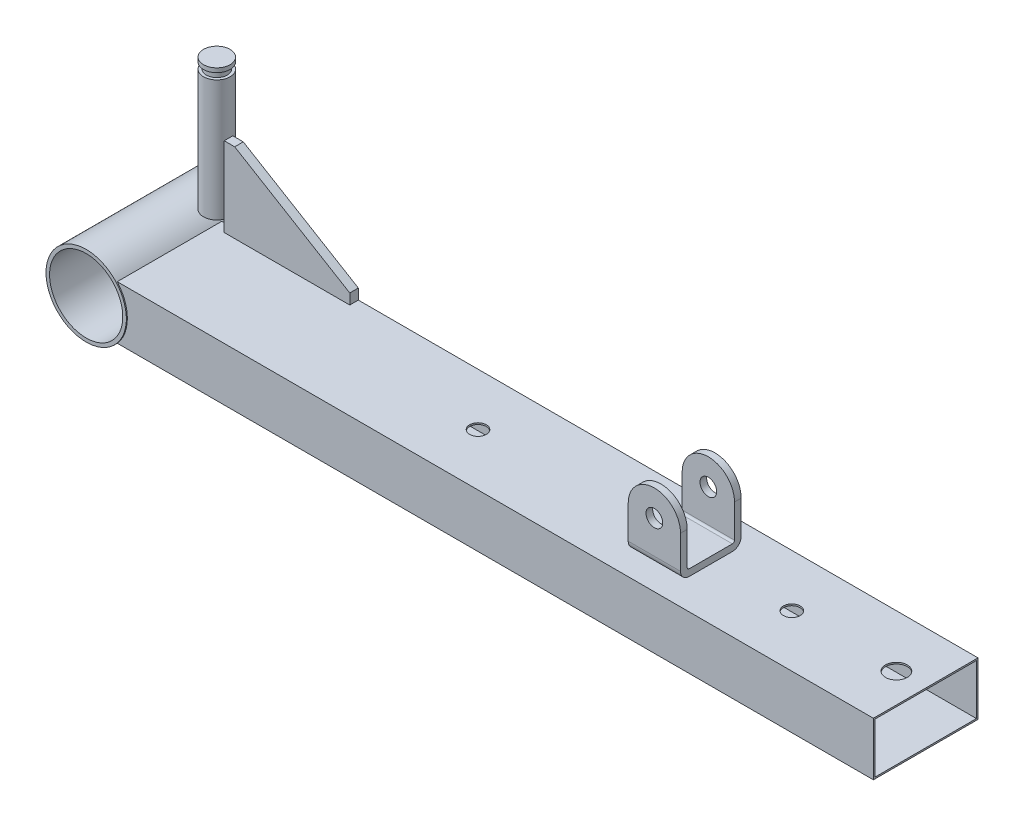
ISO-10303-21;
HEADER;
FILE_DESCRIPTION(('STEP AP214'),'2;1');
FILE_NAME('part.step','',(''),(''),'','','');
FILE_SCHEMA(('AUTOMOTIVE_DESIGN { 1 0 10303 214 1 1 1 1 }'));
ENDSEC;
DATA;
#1=APPLICATION_CONTEXT('core data for automotive mechanical design processes');
#2=APPLICATION_PROTOCOL_DEFINITION('international standard','automotive_design',2000,#1);
#3=PRODUCT_CONTEXT('',#1,'mechanical');
#4=PRODUCT('Part','Part','',(#3));
#5=PRODUCT_RELATED_PRODUCT_CATEGORY('part','',(#4));
#6=PRODUCT_DEFINITION_FORMATION('','',#4);
#7=PRODUCT_DEFINITION_CONTEXT('part definition',#1,'design');
#8=PRODUCT_DEFINITION('design','',#6,#7);
#9=PRODUCT_DEFINITION_SHAPE('','',#8);
#10=(LENGTH_UNIT() NAMED_UNIT(*) SI_UNIT(.MILLI.,.METRE.));
#11=(NAMED_UNIT(*) PLANE_ANGLE_UNIT() SI_UNIT($,.RADIAN.));
#12=(NAMED_UNIT(*) SI_UNIT($,.STERADIAN.) SOLID_ANGLE_UNIT());
#13=UNCERTAINTY_MEASURE_WITH_UNIT(LENGTH_MEASURE(1.E-05),#10,'distance_accuracy_value','');
#14=(GEOMETRIC_REPRESENTATION_CONTEXT(3) GLOBAL_UNCERTAINTY_ASSIGNED_CONTEXT((#13)) GLOBAL_UNIT_ASSIGNED_CONTEXT((#10,
#11,#12)) REPRESENTATION_CONTEXT('',''));
#15=CARTESIAN_POINT('',(0.,0.,0.));
#16=DIRECTION('',(0.,0.,1.));
#17=DIRECTION('',(1.,0.,0.));
#18=AXIS2_PLACEMENT_3D('',#15,#16,#17);
#19=CARTESIAN_POINT('',(6.674138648,80.75,18.535303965));
#20=DIRECTION('',(0.,1.,0.));
#21=DIRECTION('',(0.,0.,1.));
#22=AXIS2_PLACEMENT_3D('',#19,#20,#21);
#23=PLANE('',#22);
#24=CARTESIAN_POINT('',(13.15,80.75,25.));
#25=DIRECTION('',(0.,-1.,0.));
#26=DIRECTION('',(1.,0.,0.));
#27=AXIS2_PLACEMENT_3D('',#24,#25,#26);
#28=CIRCLE('',#27,6.35);
#29=CARTESIAN_POINT('',(19.5,80.75,25.));
#30=VERTEX_POINT('',#29);
#31=EDGE_CURVE('E38',#30,#30,#28,.T.);
#32=ORIENTED_EDGE('',*,*,#31,.F.);
#33=EDGE_LOOP('',(#32));
#34=FACE_BOUND('',#33,.T.);
#35=ADVANCED_FACE('F34',(#34),#23,.T.);
#36=CARTESIAN_POINT('',(13.15,80.75,25.));
#37=DIRECTION('',(0.,-1.,0.));
#38=DIRECTION('',(1.,0.,0.));
#39=AXIS2_PLACEMENT_3D('',#36,#37,#38);
#40=CYLINDRICAL_SURFACE('',#39,6.35);
#41=ORIENTED_EDGE('',*,*,#31,.T.);
#42=EDGE_LOOP('',(#41));
#43=FACE_BOUND('',#42,.T.);
#44=CARTESIAN_POINT('',(13.15,78.75,25.));
#45=DIRECTION('',(0.,-1.,0.));
#46=DIRECTION('',(1.,0.,0.));
#47=AXIS2_PLACEMENT_3D('',#44,#45,#46);
#48=CIRCLE('',#47,6.35);
#49=CARTESIAN_POINT('',(19.5,78.75,25.));
#50=VERTEX_POINT('',#49);
#51=EDGE_CURVE('E606',#50,#50,#48,.F.);
#52=ORIENTED_EDGE('',*,*,#51,.T.);
#53=EDGE_LOOP('',(#52));
#54=FACE_BOUND('',#53,.T.);
#55=ADVANCED_FACE('F307',(#43,#54),#40,.T.);
#56=CARTESIAN_POINT('',(6.674138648,78.75,18.535303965));
#57=DIRECTION('',(0.,1.,0.));
#58=DIRECTION('',(0.,0.,1.));
#59=AXIS2_PLACEMENT_3D('',#56,#57,#58);
#60=PLANE('',#59);
#61=CARTESIAN_POINT('',(13.15,78.75,25.));
#62=DIRECTION('',(0.,-1.,0.));
#63=DIRECTION('',(0.,0.,-1.));
#64=AXIS2_PLACEMENT_3D('',#61,#62,#63);
#65=CIRCLE('',#64,5.);
#66=CARTESIAN_POINT('',(13.15,78.75,20.));
#67=VERTEX_POINT('',#66);
#68=EDGE_CURVE('E604',#67,#67,#65,.T.);
#69=ORIENTED_EDGE('',*,*,#68,.F.);
#70=EDGE_LOOP('',(#69));
#71=FACE_BOUND('',#70,.T.);
#72=ORIENTED_EDGE('',*,*,#51,.F.);
#73=EDGE_LOOP('',(#72));
#74=FACE_BOUND('',#73,.T.);
#75=ADVANCED_FACE('F309',(#71,#74),#60,.F.);
#76=CARTESIAN_POINT('',(13.15,78.75,25.));
#77=DIRECTION('',(0.,-1.,0.));
#78=DIRECTION('',(0.,0.,-1.));
#79=AXIS2_PLACEMENT_3D('',#76,#77,#78);
#80=CYLINDRICAL_SURFACE('',#79,5.);
#81=CARTESIAN_POINT('',(13.15,75.75,25.));
#82=DIRECTION('',(0.,-1.,0.));
#83=DIRECTION('',(0.,0.,-1.));
#84=AXIS2_PLACEMENT_3D('',#81,#82,#83);
#85=CIRCLE('',#84,5.);
#86=CARTESIAN_POINT('',(13.15,75.75,20.));
#87=VERTEX_POINT('',#86);
#88=EDGE_CURVE('E601',#87,#87,#85,.T.);
#89=ORIENTED_EDGE('',*,*,#88,.F.);
#90=EDGE_LOOP('',(#89));
#91=FACE_BOUND('',#90,.T.);
#92=ORIENTED_EDGE('',*,*,#68,.T.);
#93=EDGE_LOOP('',(#92));
#94=FACE_BOUND('',#93,.T.);
#95=ADVANCED_FACE('F312',(#91,#94),#80,.T.);
#96=CARTESIAN_POINT('',(260.6,32.75,60.1));
#97=DIRECTION('',(0.,0.,1.));
#98=DIRECTION('',(1.,0.,0.));
#99=AXIS2_PLACEMENT_3D('',#96,#97,#98);
#100=CYLINDRICAL_SURFACE('',#99,3.99999999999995);
#101=CARTESIAN_POINT('',(260.6,32.75,63.3));
#102=DIRECTION('',(0.,0.,1.));
#103=DIRECTION('',(1.,0.,0.));
#104=AXIS2_PLACEMENT_3D('',#101,#102,#103);
#105=CIRCLE('',#104,3.99999999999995);
#106=CARTESIAN_POINT('',(264.6,32.75,63.3));
#107=VERTEX_POINT('',#106);
#108=EDGE_CURVE('E595',#107,#107,#105,.F.);
#109=ORIENTED_EDGE('',*,*,#108,.F.);
#110=EDGE_LOOP('',(#109));
#111=FACE_BOUND('',#110,.T.);
#112=CARTESIAN_POINT('',(260.6,32.75,60.1));
#113=DIRECTION('',(0.,0.,1.));
#114=DIRECTION('',(1.,0.,0.));
#115=AXIS2_PLACEMENT_3D('',#112,#113,#114);
#116=CIRCLE('',#115,3.99999999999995);
#117=CARTESIAN_POINT('',(264.6,32.75,60.1));
#118=VERTEX_POINT('',#117);
#119=EDGE_CURVE('E192',#118,#118,#116,.T.);
#120=ORIENTED_EDGE('',*,*,#119,.F.);
#121=EDGE_LOOP('',(#120));
#122=FACE_BOUND('',#121,.T.);
#123=ADVANCED_FACE('F620',(#111,#122),#100,.F.);
#124=CARTESIAN_POINT('',(260.6,32.75,34.3));
#125=DIRECTION('',(0.,0.,1.));
#126=DIRECTION('',(1.,0.,0.));
#127=AXIS2_PLACEMENT_3D('',#124,#125,#126);
#128=CYLINDRICAL_SURFACE('',#127,3.99999999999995);
#129=CARTESIAN_POINT('',(260.6,32.75,37.5));
#130=DIRECTION('',(0.,0.,1.));
#131=DIRECTION('',(1.,0.,0.));
#132=AXIS2_PLACEMENT_3D('',#129,#130,#131);
#133=CIRCLE('',#132,3.99999999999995);
#134=CARTESIAN_POINT('',(264.6,32.75,37.5));
#135=VERTEX_POINT('',#134);
#136=EDGE_CURVE('E553',#135,#135,#133,.F.);
#137=ORIENTED_EDGE('',*,*,#136,.F.);
#138=EDGE_LOOP('',(#137));
#139=FACE_BOUND('',#138,.T.);
#140=CARTESIAN_POINT('',(260.6,32.75,34.3));
#141=DIRECTION('',(0.,0.,1.));
#142=DIRECTION('',(1.,0.,0.));
#143=AXIS2_PLACEMENT_3D('',#140,#141,#142);
#144=CIRCLE('',#143,3.99999999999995);
#145=CARTESIAN_POINT('',(264.6,32.75,34.3));
#146=VERTEX_POINT('',#145);
#147=EDGE_CURVE('E592',#146,#146,#144,.T.);
#148=ORIENTED_EDGE('',*,*,#147,.F.);
#149=EDGE_LOOP('',(#148));
#150=FACE_BOUND('',#149,.T.);
#151=ADVANCED_FACE('F317',(#139,#150),#128,.F.);
#152=CARTESIAN_POINT('',(6.674138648,75.75,18.535303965));
#153=DIRECTION('',(0.,1.,0.));
#154=DIRECTION('',(0.,0.,1.));
#155=AXIS2_PLACEMENT_3D('',#152,#153,#154);
#156=PLANE('',#155);
#157=ORIENTED_EDGE('',*,*,#88,.T.);
#158=EDGE_LOOP('',(#157));
#159=FACE_BOUND('',#158,.T.);
#160=CARTESIAN_POINT('',(13.15,75.75,25.));
#161=DIRECTION('',(0.,-1.,0.));
#162=DIRECTION('',(0.,0.,-1.));
#163=AXIS2_PLACEMENT_3D('',#160,#161,#162);
#164=CIRCLE('',#163,6.35);
#165=CARTESIAN_POINT('',(13.15,75.75,18.65));
#166=VERTEX_POINT('',#165);
#167=EDGE_CURVE('E545',#166,#166,#164,.T.);
#168=ORIENTED_EDGE('',*,*,#167,.F.);
#169=EDGE_LOOP('',(#168));
#170=FACE_BOUND('',#169,.T.);
#171=ADVANCED_FACE('F314',(#159,#170),#156,.T.);
#172=CARTESIAN_POINT('',(273.1,16.95,60.1));
#173=DIRECTION('',(0.,0.,-1.));
#174=DIRECTION('',(-1.,0.,0.));
#175=AXIS2_PLACEMENT_3D('',#172,#173,#174);
#176=PLANE('',#175);
#177=ORIENTED_EDGE('',*,*,#119,.T.);
#178=EDGE_LOOP('',(#177));
#179=FACE_BOUND('',#178,.T.);
#180=DIRECTION('',(-1.,0.,0.));
#181=VECTOR('',#180,1.);
#182=CARTESIAN_POINT('',(260.6,16.9499999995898,60.1));
#183=LINE('',#182,#181);
#184=CARTESIAN_POINT('',(273.1,16.9499999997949,60.099999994));
#185=VERTEX_POINT('',#184);
#186=CARTESIAN_POINT('',(248.1,16.9499999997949,60.099999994));
#187=VERTEX_POINT('',#186);
#188=EDGE_CURVE('E546',#185,#187,#183,.T.);
#189=ORIENTED_EDGE('',*,*,#188,.T.);
#190=DIRECTION('',(0.,1.,0.));
#191=VECTOR('',#190,1.);
#192=CARTESIAN_POINT('',(248.1,22.75,60.099999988));
#193=LINE('',#192,#191);
#194=CARTESIAN_POINT('',(248.1,32.75,60.099999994));
#195=VERTEX_POINT('',#194);
#196=EDGE_CURVE('E187',#187,#195,#193,.T.);
#197=ORIENTED_EDGE('',*,*,#196,.T.);
#198=CARTESIAN_POINT('',(260.6,32.75,60.1));
#199=DIRECTION('',(0.,0.,1.));
#200=DIRECTION('',(1.,0.,0.));
#201=AXIS2_PLACEMENT_3D('',#198,#199,#200);
#202=CIRCLE('',#201,12.5);
#203=CARTESIAN_POINT('',(273.1,32.75,60.099999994));
#204=VERTEX_POINT('',#203);
#205=EDGE_CURVE('E184',#204,#195,#202,.T.);
#206=ORIENTED_EDGE('',*,*,#205,.F.);
#207=DIRECTION('',(0.,1.,0.));
#208=VECTOR('',#207,1.);
#209=CARTESIAN_POINT('',(273.1,22.75,60.099999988));
#210=LINE('',#209,#208);
#211=EDGE_CURVE('E171',#185,#204,#210,.T.);
#212=ORIENTED_EDGE('',*,*,#211,.F.);
#213=EDGE_LOOP('',(#189,#197,#206,#212));
#214=FACE_BOUND('',#213,.T.);
#215=ADVANCED_FACE('F185',(#179,#214),#176,.T.);
#216=CARTESIAN_POINT('',(260.6,32.75,60.1));
#217=DIRECTION('',(0.,0.,1.));
#218=DIRECTION('',(1.,0.,0.));
#219=AXIS2_PLACEMENT_3D('',#216,#217,#218);
#220=CYLINDRICAL_SURFACE('',#219,12.5);
#221=CARTESIAN_POINT('',(260.6,32.75,63.3));
#222=DIRECTION('',(0.,0.,-1.));
#223=DIRECTION('',(-1.,0.,0.));
#224=AXIS2_PLACEMENT_3D('',#221,#222,#223);
#225=CIRCLE('',#224,12.5000000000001);
#226=CARTESIAN_POINT('',(273.1,32.75,63.3));
#227=VERTEX_POINT('',#226);
#228=CARTESIAN_POINT('',(248.1,32.75,63.3));
#229=VERTEX_POINT('',#228);
#230=EDGE_CURVE('E191',#227,#229,#225,.F.);
#231=ORIENTED_EDGE('',*,*,#230,.F.);
#232=DIRECTION('',(0.,0.,1.));
#233=VECTOR('',#232,1.);
#234=CARTESIAN_POINT('',(273.1,32.75,48.8));
#235=LINE('',#234,#233);
#236=EDGE_CURVE('E175',#204,#227,#235,.T.);
#237=ORIENTED_EDGE('',*,*,#236,.F.);
#238=ORIENTED_EDGE('',*,*,#205,.T.);
#239=DIRECTION('',(0.,0.,1.));
#240=VECTOR('',#239,1.);
#241=CARTESIAN_POINT('',(248.1,32.75,48.8));
#242=LINE('',#241,#240);
#243=EDGE_CURVE('E203',#195,#229,#242,.T.);
#244=ORIENTED_EDGE('',*,*,#243,.T.);
#245=EDGE_LOOP('',(#231,#237,#238,#244));
#246=FACE_BOUND('',#245,.T.);
#247=ADVANCED_FACE('F194',(#246),#220,.T.);
#248=CARTESIAN_POINT('',(248.1,16.95,63.3));
#249=DIRECTION('',(0.,0.,1.));
#250=DIRECTION('',(1.,0.,0.));
#251=AXIS2_PLACEMENT_3D('',#248,#249,#250);
#252=PLANE('',#251);
#253=ORIENTED_EDGE('',*,*,#108,.T.);
#254=EDGE_LOOP('',(#253));
#255=FACE_BOUND('',#254,.T.);
#256=DIRECTION('',(0.,-1.,0.));
#257=VECTOR('',#256,1.);
#258=CARTESIAN_POINT('',(248.1,22.75,63.3));
#259=LINE('',#258,#257);
#260=CARTESIAN_POINT('',(248.1,16.9499999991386,63.3));
#261=VERTEX_POINT('',#260);
#262=EDGE_CURVE('E205',#229,#261,#259,.T.);
#263=ORIENTED_EDGE('',*,*,#262,.T.);
#264=DIRECTION('',(-1.,0.,0.));
#265=VECTOR('',#264,1.);
#266=CARTESIAN_POINT('',(260.6,16.9499999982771,63.3));
#267=LINE('',#266,#265);
#268=CARTESIAN_POINT('',(273.1,16.9499999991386,63.3));
#269=VERTEX_POINT('',#268);
#270=EDGE_CURVE('E201',#269,#261,#267,.T.);
#271=ORIENTED_EDGE('',*,*,#270,.F.);
#272=DIRECTION('',(0.,-1.,0.));
#273=VECTOR('',#272,1.);
#274=CARTESIAN_POINT('',(273.1,22.75,63.3));
#275=LINE('',#274,#273);
#276=EDGE_CURVE('E195',#227,#269,#275,.T.);
#277=ORIENTED_EDGE('',*,*,#276,.F.);
#278=ORIENTED_EDGE('',*,*,#230,.T.);
#279=EDGE_LOOP('',(#263,#271,#277,#278));
#280=FACE_BOUND('',#279,.T.);
#281=ADVANCED_FACE('F322',(#255,#280),#252,.T.);
#282=CARTESIAN_POINT('',(273.1,16.95,34.3));
#283=DIRECTION('',(0.,0.,-1.));
#284=DIRECTION('',(-1.,0.,0.));
#285=AXIS2_PLACEMENT_3D('',#282,#283,#284);
#286=PLANE('',#285);
#287=ORIENTED_EDGE('',*,*,#147,.T.);
#288=EDGE_LOOP('',(#287));
#289=FACE_BOUND('',#288,.T.);
#290=DIRECTION('',(1.,0.,0.));
#291=VECTOR('',#290,1.);
#292=CARTESIAN_POINT('',(260.6,16.9499999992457,34.3));
#293=LINE('',#292,#291);
#294=CARTESIAN_POINT('',(248.1,16.9499999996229,34.3));
#295=VERTEX_POINT('',#294);
#296=CARTESIAN_POINT('',(273.1,16.9499999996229,34.3));
#297=VERTEX_POINT('',#296);
#298=EDGE_CURVE('E180',#295,#297,#293,.T.);
#299=ORIENTED_EDGE('',*,*,#298,.F.);
#300=DIRECTION('',(0.,1.,0.));
#301=VECTOR('',#300,1.);
#302=CARTESIAN_POINT('',(248.1,22.75,34.3));
#303=LINE('',#302,#301);
#304=CARTESIAN_POINT('',(248.1,32.75,34.3));
#305=VERTEX_POINT('',#304);
#306=EDGE_CURVE('E209',#295,#305,#303,.T.);
#307=ORIENTED_EDGE('',*,*,#306,.T.);
#308=CARTESIAN_POINT('',(260.6,32.75,34.3));
#309=DIRECTION('',(0.,0.,1.));
#310=DIRECTION('',(1.,0.,0.));
#311=AXIS2_PLACEMENT_3D('',#308,#309,#310);
#312=CIRCLE('',#311,12.5);
#313=CARTESIAN_POINT('',(273.1,32.75,34.3));
#314=VERTEX_POINT('',#313);
#315=EDGE_CURVE('E590',#314,#305,#312,.T.);
#316=ORIENTED_EDGE('',*,*,#315,.F.);
#317=DIRECTION('',(0.,1.,0.));
#318=VECTOR('',#317,1.);
#319=CARTESIAN_POINT('',(273.1,22.75,34.3));
#320=LINE('',#319,#318);
#321=EDGE_CURVE('E557',#297,#314,#320,.T.);
#322=ORIENTED_EDGE('',*,*,#321,.F.);
#323=EDGE_LOOP('',(#299,#307,#316,#322));
#324=FACE_BOUND('',#323,.T.);
#325=ADVANCED_FACE('F325',(#289,#324),#286,.T.);
#326=CARTESIAN_POINT('',(260.6,32.75,34.3));
#327=DIRECTION('',(0.,0.,1.));
#328=DIRECTION('',(1.,0.,0.));
#329=AXIS2_PLACEMENT_3D('',#326,#327,#328);
#330=CYLINDRICAL_SURFACE('',#329,12.5);
#331=CARTESIAN_POINT('',(260.6,32.75,37.5));
#332=DIRECTION('',(0.,0.,-1.));
#333=DIRECTION('',(-1.,0.,0.));
#334=AXIS2_PLACEMENT_3D('',#331,#332,#333);
#335=CIRCLE('',#334,12.5000000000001);
#336=CARTESIAN_POINT('',(273.1,32.75,37.500000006));
#337=VERTEX_POINT('',#336);
#338=CARTESIAN_POINT('',(248.1,32.75,37.500000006));
#339=VERTEX_POINT('',#338);
#340=EDGE_CURVE('E588',#337,#339,#335,.F.);
#341=ORIENTED_EDGE('',*,*,#340,.F.);
#342=DIRECTION('',(0.,0.,1.));
#343=VECTOR('',#342,1.);
#344=CARTESIAN_POINT('',(273.1,32.75,48.8));
#345=LINE('',#344,#343);
#346=EDGE_CURVE('E554',#314,#337,#345,.T.);
#347=ORIENTED_EDGE('',*,*,#346,.F.);
#348=ORIENTED_EDGE('',*,*,#315,.T.);
#349=DIRECTION('',(0.,0.,1.));
#350=VECTOR('',#349,1.);
#351=CARTESIAN_POINT('',(248.1,32.75,48.8));
#352=LINE('',#351,#350);
#353=EDGE_CURVE('E206',#305,#339,#352,.T.);
#354=ORIENTED_EDGE('',*,*,#353,.T.);
#355=EDGE_LOOP('',(#341,#347,#348,#354));
#356=FACE_BOUND('',#355,.T.);
#357=ADVANCED_FACE('F329',(#356),#330,.T.);
#358=CARTESIAN_POINT('',(248.1,16.95,37.5));
#359=DIRECTION('',(0.,0.,1.));
#360=DIRECTION('',(1.,0.,0.));
#361=AXIS2_PLACEMENT_3D('',#358,#359,#360);
#362=PLANE('',#361);
#363=ORIENTED_EDGE('',*,*,#136,.T.);
#364=EDGE_LOOP('',(#363));
#365=FACE_BOUND('',#364,.T.);
#366=DIRECTION('',(0.,-1.,0.));
#367=VECTOR('',#366,1.);
#368=CARTESIAN_POINT('',(248.1,22.75,37.500000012));
#369=LINE('',#368,#367);
#370=CARTESIAN_POINT('',(248.1,16.9499999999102,37.500000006));
#371=VERTEX_POINT('',#370);
#372=EDGE_CURVE('E208',#339,#371,#369,.T.);
#373=ORIENTED_EDGE('',*,*,#372,.T.);
#374=DIRECTION('',(1.,0.,0.));
#375=VECTOR('',#374,1.);
#376=CARTESIAN_POINT('',(260.6,16.9499999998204,37.5));
#377=LINE('',#376,#375);
#378=CARTESIAN_POINT('',(273.1,16.9499999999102,37.500000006));
#379=VERTEX_POINT('',#378);
#380=EDGE_CURVE('E550',#371,#379,#377,.T.);
#381=ORIENTED_EDGE('',*,*,#380,.T.);
#382=DIRECTION('',(0.,-1.,0.));
#383=VECTOR('',#382,1.);
#384=CARTESIAN_POINT('',(273.1,22.75,37.500000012));
#385=LINE('',#384,#383);
#386=EDGE_CURVE('E556',#337,#379,#385,.T.);
#387=ORIENTED_EDGE('',*,*,#386,.F.);
#388=ORIENTED_EDGE('',*,*,#340,.T.);
#389=EDGE_LOOP('',(#373,#381,#387,#388));
#390=FACE_BOUND('',#389,.T.);
#391=ADVANCED_FACE('F331',(#365,#390),#362,.T.);
#392=CARTESIAN_POINT('',(248.1,16.95,38.5));
#393=DIRECTION('',(1.,0.,0.));
#394=DIRECTION('',(0.,0.,-1.));
#395=AXIS2_PLACEMENT_3D('',#392,#393,#394);
#396=CYLINDRICAL_SURFACE('',#395,1.);
#397=ORIENTED_EDGE('',*,*,#380,.F.);
#398=CARTESIAN_POINT('',(248.1,16.95,38.5));
#399=DIRECTION('',(1.,0.,0.));
#400=DIRECTION('',(0.,0.,-1.));
#401=AXIS2_PLACEMENT_3D('',#398,#399,#400);
#402=CIRCLE('',#401,1.);
#403=CARTESIAN_POINT('',(248.1,15.95,38.5));
#404=VERTEX_POINT('',#403);
#405=EDGE_CURVE('E576',#371,#404,#402,.F.);
#406=ORIENTED_EDGE('',*,*,#405,.T.);
#407=DIRECTION('',(-1.,0.,0.));
#408=VECTOR('',#407,1.);
#409=CARTESIAN_POINT('',(260.6,15.95,38.5));
#410=LINE('',#409,#408);
#411=CARTESIAN_POINT('',(273.1,15.95,38.5));
#412=VERTEX_POINT('',#411);
#413=EDGE_CURVE('E548',#412,#404,#410,.T.);
#414=ORIENTED_EDGE('',*,*,#413,.F.);
#415=CARTESIAN_POINT('',(273.1,16.95,38.5));
#416=DIRECTION('',(1.,0.,0.));
#417=DIRECTION('',(0.,0.,-1.));
#418=AXIS2_PLACEMENT_3D('',#415,#416,#417);
#419=CIRCLE('',#418,1.);
#420=EDGE_CURVE('E654',#379,#412,#419,.F.);
#421=ORIENTED_EDGE('',*,*,#420,.F.);
#422=EDGE_LOOP('',(#397,#406,#414,#421));
#423=FACE_BOUND('',#422,.T.);
#424=ADVANCED_FACE('F334',(#423),#396,.F.);
#425=CARTESIAN_POINT('',(248.1,15.95,38.5));
#426=DIRECTION('',(0.,1.,0.));
#427=DIRECTION('',(0.,0.,1.));
#428=AXIS2_PLACEMENT_3D('',#425,#426,#427);
#429=PLANE('',#428);
#430=DIRECTION('',(0.,0.,1.));
#431=VECTOR('',#430,1.);
#432=CARTESIAN_POINT('',(248.1,15.95,48.8));
#433=LINE('',#432,#431);
#434=CARTESIAN_POINT('',(248.1,15.95,59.1000000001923));
#435=VERTEX_POINT('',#434);
#436=EDGE_CURVE('E575',#404,#435,#433,.T.);
#437=ORIENTED_EDGE('',*,*,#436,.T.);
#438=DIRECTION('',(1.,0.,0.));
#439=VECTOR('',#438,1.);
#440=CARTESIAN_POINT('',(260.6,15.95,59.1000000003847));
#441=LINE('',#440,#439);
#442=CARTESIAN_POINT('',(273.1,15.95,59.1000000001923));
#443=VERTEX_POINT('',#442);
#444=EDGE_CURVE('E542',#435,#443,#441,.T.);
#445=ORIENTED_EDGE('',*,*,#444,.T.);
#446=DIRECTION('',(0.,0.,1.));
#447=VECTOR('',#446,1.);
#448=CARTESIAN_POINT('',(273.1,15.95,48.8));
#449=LINE('',#448,#447);
#450=EDGE_CURVE('E651',#412,#443,#449,.T.);
#451=ORIENTED_EDGE('',*,*,#450,.F.);
#452=ORIENTED_EDGE('',*,*,#413,.T.);
#453=EDGE_LOOP('',(#437,#445,#451,#452));
#454=FACE_BOUND('',#453,.T.);
#455=ADVANCED_FACE('F336',(#454),#429,.T.);
#456=CARTESIAN_POINT('',(248.1,16.95,59.1));
#457=DIRECTION('',(1.,0.,0.));
#458=DIRECTION('',(0.,0.,-1.));
#459=AXIS2_PLACEMENT_3D('',#456,#457,#458);
#460=CYLINDRICAL_SURFACE('',#459,0.999999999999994);
#461=ORIENTED_EDGE('',*,*,#444,.F.);
#462=CARTESIAN_POINT('',(248.1,16.95,59.1));
#463=DIRECTION('',(1.,0.,0.));
#464=DIRECTION('',(0.,0.,-1.));
#465=AXIS2_PLACEMENT_3D('',#462,#463,#464);
#466=CIRCLE('',#465,0.999999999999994);
#467=EDGE_CURVE('E572',#435,#187,#466,.F.);
#468=ORIENTED_EDGE('',*,*,#467,.T.);
#469=ORIENTED_EDGE('',*,*,#188,.F.);
#470=CARTESIAN_POINT('',(273.1,16.95,59.1));
#471=DIRECTION('',(1.,0.,0.));
#472=DIRECTION('',(0.,0.,-1.));
#473=AXIS2_PLACEMENT_3D('',#470,#471,#472);
#474=CIRCLE('',#473,0.999999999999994);
#475=EDGE_CURVE('E178',#443,#185,#474,.F.);
#476=ORIENTED_EDGE('',*,*,#475,.F.);
#477=EDGE_LOOP('',(#461,#468,#469,#476));
#478=FACE_BOUND('',#477,.T.);
#479=ADVANCED_FACE('F339',(#478),#460,.F.);
#480=CARTESIAN_POINT('',(0.,0.,74.3));
#481=DIRECTION('',(0.,0.,-1.));
#482=DIRECTION('',(-1.,0.,0.));
#483=AXIS2_PLACEMENT_3D('',#480,#481,#482);
#484=CYLINDRICAL_SURFACE('',#483,17.5);
#485=CARTESIAN_POINT('',(0.,0.,0.));
#486=DIRECTION('',(0.,0.,-1.));
#487=DIRECTION('',(-1.,0.,0.));
#488=AXIS2_PLACEMENT_3D('',#485,#486,#487);
#489=CIRCLE('',#488,17.5);
#490=CARTESIAN_POINT('',(-17.5,0.,0.));
#491=VERTEX_POINT('',#490);
#492=EDGE_CURVE('E276',#491,#491,#489,.T.);
#493=ORIENTED_EDGE('',*,*,#492,.T.);
#494=EDGE_LOOP('',(#493));
#495=FACE_BOUND('',#494,.T.);
#496=CARTESIAN_POINT('',(0.,0.,74.3));
#497=DIRECTION('',(0.,0.,-1.));
#498=DIRECTION('',(-1.,0.,0.));
#499=AXIS2_PLACEMENT_3D('',#496,#497,#498);
#500=CIRCLE('',#499,17.5);
#501=CARTESIAN_POINT('',(-17.5,0.,74.3));
#502=VERTEX_POINT('',#501);
#503=EDGE_CURVE('E650',#502,#502,#500,.T.);
#504=ORIENTED_EDGE('',*,*,#503,.F.);
#505=EDGE_LOOP('',(#504));
#506=FACE_BOUND('',#505,.T.);
#507=ADVANCED_FACE('F637',(#495,#506),#484,.F.);
#508=CARTESIAN_POINT('',(13.15,75.75,25.));
#509=DIRECTION('',(0.,-1.,0.));
#510=DIRECTION('',(0.,0.,-1.));
#511=AXIS2_PLACEMENT_3D('',#508,#509,#510);
#512=CYLINDRICAL_SURFACE('',#511,6.35);
#513=ORIENTED_EDGE('',*,*,#167,.T.);
#514=EDGE_LOOP('',(#513));
#515=FACE_BOUND('',#514,.T.);
#516=CARTESIAN_POINT('',(7.31966529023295,17.7500000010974,27.515888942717));
#517=CARTESIAN_POINT('',(7.25426066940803,17.776958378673,27.3643841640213));
#518=CARTESIAN_POINT('',(7.19462853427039,17.8011384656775,27.2098945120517));
#519=CARTESIAN_POINT('',(7.08742070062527,17.8441006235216,26.8960596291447));
#520=CARTESIAN_POINT('',(7.03984486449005,17.8628827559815,26.7367144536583));
#521=CARTESIAN_POINT('',(6.95727368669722,17.8952026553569,26.4143342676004));
#522=CARTESIAN_POINT('',(6.92227405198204,17.9087422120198,26.2513005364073));
#523=CARTESIAN_POINT('',(6.86517591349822,17.9307084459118,25.9226570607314));
#524=CARTESIAN_POINT('',(6.84307688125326,17.9391353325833,25.7570474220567));
#525=CARTESIAN_POINT('',(6.81198484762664,17.9509648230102,25.4242807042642));
#526=CARTESIAN_POINT('',(6.8030030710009,17.9543631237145,25.2571224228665));
#527=CARTESIAN_POINT('',(6.79826854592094,17.9561563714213,24.9225924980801));
#528=CARTESIAN_POINT('',(6.80251582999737,17.9545513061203,24.7552208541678));
#529=CARTESIAN_POINT('',(6.82418935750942,17.9463248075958,24.4216153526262));
#530=CARTESIAN_POINT('',(6.84160287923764,17.9397082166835,24.2553805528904));
#531=CARTESIAN_POINT('',(6.88940823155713,17.9214035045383,23.9251364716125));
#532=CARTESIAN_POINT('',(6.91979624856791,17.9097168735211,23.761126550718));
#533=CARTESIAN_POINT('',(6.99991924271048,17.8785713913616,23.4070099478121));
#534=CARTESIAN_POINT('',(7.05215928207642,17.8580891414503,23.2175481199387));
#535=CARTESIAN_POINT('',(7.14317671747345,17.8217866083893,22.9384082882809));
#536=CARTESIAN_POINT('',(7.17561048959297,17.8087619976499,22.8462383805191));
#537=CARTESIAN_POINT('',(7.24458535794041,17.7808144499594,22.6637445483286));
#538=CARTESIAN_POINT('',(7.28112633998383,17.7658915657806,22.5734205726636));
#539=CARTESIAN_POINT('',(7.31966529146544,17.7500000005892,22.4841110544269));
#540=B_SPLINE_CURVE_WITH_KNOTS('',3,(#516,#517,#518,#519,#520,#521,#522,#523,#524,#525,#526,
#527,#528,#529,#530,#531,#532,#533,#534,#535,#536,#537,#538,#539),.UNSPECIFIED.,.F.,.F.,(4,2,2,
2,2,2,2,2,2,2,2,4),(0.,0.501472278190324,1.00293883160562,1.50423403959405,2.00550871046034,
2.50721208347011,3.00891669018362,3.51013714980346,4.0112103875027,4.60290613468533,
4.89852622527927,5.19413809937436),.UNSPECIFIED.);
#541=CARTESIAN_POINT('',(7.31966529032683,17.7500000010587,27.5158889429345));
#542=VERTEX_POINT('',#541);
#543=CARTESIAN_POINT('',(7.31966528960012,17.7500000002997,22.4841110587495));
#544=VERTEX_POINT('',#543);
#545=EDGE_CURVE('E266',#542,#544,#540,.T.);
#546=ORIENTED_EDGE('',*,*,#545,.F.);
#547=CARTESIAN_POINT('',(13.15,17.75,25.));
#548=DIRECTION('',(0.,-1.,0.));
#549=DIRECTION('',(0.,0.,-1.));
#550=AXIS2_PLACEMENT_3D('',#547,#548,#549);
#551=CIRCLE('',#550,6.35);
#552=EDGE_CURVE('E582',#542,#544,#551,.F.);
#553=ORIENTED_EDGE('',*,*,#552,.T.);
#554=EDGE_LOOP('',(#546,#553));
#555=FACE_BOUND('',#554,.T.);
#556=ADVANCED_FACE('F278',(#515,#555),#512,.T.);
#557=CARTESIAN_POINT('',(7.319665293,17.75,18.522191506));
#558=DIRECTION('',(0.,1.,0.));
#559=DIRECTION('',(0.,0.,1.));
#560=AXIS2_PLACEMENT_3D('',#557,#558,#559);
#561=PLANE('',#560);
#562=DIRECTION('',(0.,0.,1.));
#563=VECTOR('',#562,1.);
#564=CARTESIAN_POINT('',(7.31966528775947,17.7500000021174,37.15));
#565=LINE('',#564,#563);
#566=EDGE_CURVE('E275',#544,#542,#565,.T.);
#567=ORIENTED_EDGE('',*,*,#566,.F.);
#568=ORIENTED_EDGE('',*,*,#552,.F.);
#569=EDGE_LOOP('',(#567,#568));
#570=FACE_BOUND('',#569,.T.);
#571=ADVANCED_FACE('F341',(#570),#561,.F.);
#572=CARTESIAN_POINT('',(19.6,12.75,27.9));
#573=DIRECTION('',(0.,0.,-1.));
#574=DIRECTION('',(0.,1.,0.));
#575=AXIS2_PLACEMENT_3D('',#572,#573,#574);
#576=PLANE('',#575);
#577=DIRECTION('',(-1.,0.,0.));
#578=VECTOR('',#577,1.);
#579=CARTESIAN_POINT('',(195.0776998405,12.75,27.9));
#580=LINE('',#579,#578);
#581=CARTESIAN_POINT('',(79.6000000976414,12.75,27.9));
#582=VERTEX_POINT('',#581);
#583=CARTESIAN_POINT('',(19.5999999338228,12.75,27.9));
#584=VERTEX_POINT('',#583);
#585=EDGE_CURVE('E265',#582,#584,#580,.T.);
#586=ORIENTED_EDGE('',*,*,#585,.F.);
#587=DIRECTION('',(0.,-1.,0.));
#588=VECTOR('',#587,1.);
#589=CARTESIAN_POINT('',(79.6,15.25,27.9));
#590=LINE('',#589,#588);
#591=CARTESIAN_POINT('',(79.6,17.75,27.9));
#592=VERTEX_POINT('',#591);
#593=EDGE_CURVE('E482',#592,#582,#590,.T.);
#594=ORIENTED_EDGE('',*,*,#593,.F.);
#595=DIRECTION('',(0.857492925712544,-0.514495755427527,0.));
#596=VECTOR('',#595,1.);
#597=CARTESIAN_POINT('',(52.1,34.25,27.9));
#598=LINE('',#597,#596);
#599=CARTESIAN_POINT('',(24.6,50.75,27.9));
#600=VERTEX_POINT('',#599);
#601=EDGE_CURVE('E483',#600,#592,#598,.T.);
#602=ORIENTED_EDGE('',*,*,#601,.F.);
#603=DIRECTION('',(1.,0.,0.));
#604=VECTOR('',#603,1.);
#605=CARTESIAN_POINT('',(22.1,50.75,27.9));
#606=LINE('',#605,#604);
#607=CARTESIAN_POINT('',(19.6,50.75,27.9));
#608=VERTEX_POINT('',#607);
#609=EDGE_CURVE('E489',#608,#600,#606,.T.);
#610=ORIENTED_EDGE('',*,*,#609,.F.);
#611=DIRECTION('',(0.,1.,0.));
#612=VECTOR('',#611,1.);
#613=CARTESIAN_POINT('',(19.6,31.75,27.9));
#614=LINE('',#613,#612);
#615=EDGE_CURVE('E499',#584,#608,#614,.T.);
#616=ORIENTED_EDGE('',*,*,#615,.F.);
#617=EDGE_LOOP('',(#586,#594,#602,#610,#616));
#618=FACE_BOUND('',#617,.T.);
#619=ADVANCED_FACE('F344',(#618),#576,.F.);
#620=CARTESIAN_POINT('',(248.1,16.95,59.1));
#621=DIRECTION('',(1.,0.,0.));
#622=DIRECTION('',(0.,0.,-1.));
#623=AXIS2_PLACEMENT_3D('',#620,#621,#622);
#624=CYLINDRICAL_SURFACE('',#623,4.2);
#625=CARTESIAN_POINT('',(248.1,16.95,59.1));
#626=DIRECTION('',(1.,0.,0.));
#627=DIRECTION('',(0.,0.,-1.));
#628=AXIS2_PLACEMENT_3D('',#625,#626,#627);
#629=CIRCLE('',#628,4.2);
#630=CARTESIAN_POINT('',(248.099999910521,12.75,59.1));
#631=VERTEX_POINT('',#630);
#632=EDGE_CURVE('E579',#261,#631,#629,.T.);
#633=ORIENTED_EDGE('',*,*,#632,.T.);
#634=DIRECTION('',(-1.,0.,0.));
#635=VECTOR('',#634,1.);
#636=CARTESIAN_POINT('',(195.0776998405,12.75,59.1));
#637=LINE('',#636,#635);
#638=CARTESIAN_POINT('',(273.100000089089,12.75,59.1));
#639=VERTEX_POINT('',#638);
#640=EDGE_CURVE('E258',#639,#631,#637,.T.);
#641=ORIENTED_EDGE('',*,*,#640,.F.);
#642=CARTESIAN_POINT('',(273.1,16.95,59.1));
#643=DIRECTION('',(1.,0.,0.));
#644=DIRECTION('',(0.,0.,-1.));
#645=AXIS2_PLACEMENT_3D('',#642,#643,#644);
#646=CIRCLE('',#645,4.2);
#647=EDGE_CURVE('E197',#269,#639,#646,.T.);
#648=ORIENTED_EDGE('',*,*,#647,.F.);
#649=ORIENTED_EDGE('',*,*,#270,.T.);
#650=EDGE_LOOP('',(#633,#641,#648,#649));
#651=FACE_BOUND('',#650,.T.);
#652=ADVANCED_FACE('F348',(#651),#624,.T.);
#653=CARTESIAN_POINT('',(248.1,12.75,63.3));
#654=DIRECTION('',(1.,0.,0.));
#655=DIRECTION('',(0.,0.,-1.));
#656=AXIS2_PLACEMENT_3D('',#653,#654,#655);
#657=PLANE('',#656);
#658=ORIENTED_EDGE('',*,*,#243,.F.);
#659=ORIENTED_EDGE('',*,*,#196,.F.);
#660=ORIENTED_EDGE('',*,*,#467,.F.);
#661=ORIENTED_EDGE('',*,*,#436,.F.);
#662=ORIENTED_EDGE('',*,*,#405,.F.);
#663=ORIENTED_EDGE('',*,*,#372,.F.);
#664=ORIENTED_EDGE('',*,*,#353,.F.);
#665=ORIENTED_EDGE('',*,*,#306,.F.);
#666=CARTESIAN_POINT('',(248.1,16.95,38.5));
#667=DIRECTION('',(1.,0.,0.));
#668=DIRECTION('',(0.,0.,-1.));
#669=AXIS2_PLACEMENT_3D('',#666,#667,#668);
#670=CIRCLE('',#669,4.2);
#671=CARTESIAN_POINT('',(248.099999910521,12.75,38.5));
#672=VERTEX_POINT('',#671);
#673=EDGE_CURVE('E558',#672,#295,#670,.T.);
#674=ORIENTED_EDGE('',*,*,#673,.F.);
#675=DIRECTION('',(0.,0.,-1.));
#676=VECTOR('',#675,1.);
#677=CARTESIAN_POINT('',(248.099999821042,12.75,48.8));
#678=LINE('',#677,#676);
#679=EDGE_CURVE('E515',#631,#672,#678,.T.);
#680=ORIENTED_EDGE('',*,*,#679,.F.);
#681=ORIENTED_EDGE('',*,*,#632,.F.);
#682=ORIENTED_EDGE('',*,*,#262,.F.);
#683=EDGE_LOOP('',(#658,#659,#660,#661,#662,#663,#664,#665,#674,#680,#681,#682));
#684=FACE_BOUND('',#683,.T.);
#685=ADVANCED_FACE('F350',(#684),#657,.F.);
#686=CARTESIAN_POINT('',(248.1,16.95,38.5));
#687=DIRECTION('',(1.,0.,0.));
#688=DIRECTION('',(0.,0.,-1.));
#689=AXIS2_PLACEMENT_3D('',#686,#687,#688);
#690=CYLINDRICAL_SURFACE('',#689,4.2);
#691=ORIENTED_EDGE('',*,*,#673,.T.);
#692=ORIENTED_EDGE('',*,*,#298,.T.);
#693=CARTESIAN_POINT('',(273.1,16.95,38.5));
#694=DIRECTION('',(1.,0.,0.));
#695=DIRECTION('',(0.,0.,-1.));
#696=AXIS2_PLACEMENT_3D('',#693,#694,#695);
#697=CIRCLE('',#696,4.2);
#698=CARTESIAN_POINT('',(273.100000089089,12.75,38.5));
#699=VERTEX_POINT('',#698);
#700=EDGE_CURVE('E655',#699,#297,#697,.T.);
#701=ORIENTED_EDGE('',*,*,#700,.F.);
#702=DIRECTION('',(1.,0.,0.));
#703=VECTOR('',#702,1.);
#704=CARTESIAN_POINT('',(195.0776998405,12.75,38.5));
#705=LINE('',#704,#703);
#706=EDGE_CURVE('E513',#672,#699,#705,.T.);
#707=ORIENTED_EDGE('',*,*,#706,.F.);
#708=EDGE_LOOP('',(#691,#692,#701,#707));
#709=FACE_BOUND('',#708,.T.);
#710=ADVANCED_FACE('F353',(#709),#690,.T.);
#711=CARTESIAN_POINT('',(273.1,12.75,63.3));
#712=DIRECTION('',(1.,0.,0.));
#713=DIRECTION('',(0.,0.,-1.));
#714=AXIS2_PLACEMENT_3D('',#711,#712,#713);
#715=PLANE('',#714);
#716=ORIENTED_EDGE('',*,*,#450,.T.);
#717=ORIENTED_EDGE('',*,*,#475,.T.);
#718=ORIENTED_EDGE('',*,*,#211,.T.);
#719=ORIENTED_EDGE('',*,*,#236,.T.);
#720=ORIENTED_EDGE('',*,*,#276,.T.);
#721=ORIENTED_EDGE('',*,*,#647,.T.);
#722=DIRECTION('',(0.,0.,1.));
#723=VECTOR('',#722,1.);
#724=CARTESIAN_POINT('',(273.100000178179,12.75,48.8));
#725=LINE('',#724,#723);
#726=EDGE_CURVE('E254',#699,#639,#725,.T.);
#727=ORIENTED_EDGE('',*,*,#726,.F.);
#728=ORIENTED_EDGE('',*,*,#700,.T.);
#729=ORIENTED_EDGE('',*,*,#321,.T.);
#730=ORIENTED_EDGE('',*,*,#346,.T.);
#731=ORIENTED_EDGE('',*,*,#386,.T.);
#732=ORIENTED_EDGE('',*,*,#420,.T.);
#733=EDGE_LOOP('',(#716,#717,#718,#719,#720,#721,#727,#728,#729,#730,#731,#732));
#734=FACE_BOUND('',#733,.T.);
#735=ADVANCED_FACE('F173',(#734),#715,.T.);
#736=CARTESIAN_POINT('',(161.8,12.,48.8));
#737=DIRECTION('',(0.,1.,0.));
#738=DIRECTION('',(0.,0.,1.));
#739=AXIS2_PLACEMENT_3D('',#736,#737,#738);
#740=CYLINDRICAL_SURFACE('',#739,4.);
#741=CARTESIAN_POINT('',(161.8,12.75,48.8));
#742=DIRECTION('',(0.,1.,0.));
#743=DIRECTION('',(0.,0.,1.));
#744=AXIS2_PLACEMENT_3D('',#741,#742,#743);
#745=CIRCLE('',#744,4.);
#746=CARTESIAN_POINT('',(161.8,12.75,52.8));
#747=VERTEX_POINT('',#746);
#748=EDGE_CURVE('E262',#747,#747,#745,.F.);
#749=ORIENTED_EDGE('',*,*,#748,.F.);
#750=EDGE_LOOP('',(#749));
#751=FACE_BOUND('',#750,.T.);
#752=CARTESIAN_POINT('',(161.8,12.,48.8));
#753=DIRECTION('',(0.,1.,0.));
#754=DIRECTION('',(0.,0.,1.));
#755=AXIS2_PLACEMENT_3D('',#752,#753,#754);
#756=CIRCLE('',#755,4.);
#757=CARTESIAN_POINT('',(161.8,12.,52.8));
#758=VERTEX_POINT('',#757);
#759=EDGE_CURVE('E251',#758,#758,#756,.F.);
#760=ORIENTED_EDGE('',*,*,#759,.T.);
#761=EDGE_LOOP('',(#760));
#762=FACE_BOUND('',#761,.T.);
#763=ADVANCED_FACE('F357',(#751,#762),#740,.F.);
#764=CARTESIAN_POINT('',(361.8,12.,48.8));
#765=DIRECTION('',(0.,1.,0.));
#766=DIRECTION('',(0.,0.,1.));
#767=AXIS2_PLACEMENT_3D('',#764,#765,#766);
#768=CYLINDRICAL_SURFACE('',#767,5.2);
#769=CARTESIAN_POINT('',(361.8,12.75,48.8));
#770=DIRECTION('',(0.,1.,0.));
#771=DIRECTION('',(0.,0.,1.));
#772=AXIS2_PLACEMENT_3D('',#769,#770,#771);
#773=CIRCLE('',#772,5.2);
#774=CARTESIAN_POINT('',(361.8,12.75,54.));
#775=VERTEX_POINT('',#774);
#776=EDGE_CURVE('E259',#775,#775,#773,.F.);
#777=ORIENTED_EDGE('',*,*,#776,.F.);
#778=EDGE_LOOP('',(#777));
#779=FACE_BOUND('',#778,.T.);
#780=CARTESIAN_POINT('',(361.8,12.,48.8));
#781=DIRECTION('',(0.,1.,0.));
#782=DIRECTION('',(0.,0.,1.));
#783=AXIS2_PLACEMENT_3D('',#780,#781,#782);
#784=CIRCLE('',#783,5.2);
#785=CARTESIAN_POINT('',(361.8,12.,54.));
#786=VERTEX_POINT('',#785);
#787=EDGE_CURVE('E248',#786,#786,#784,.F.);
#788=ORIENTED_EDGE('',*,*,#787,.T.);
#789=EDGE_LOOP('',(#788));
#790=FACE_BOUND('',#789,.T.);
#791=ADVANCED_FACE('F675',(#779,#790),#768,.F.);
#792=CARTESIAN_POINT('',(311.8,12.,48.8));
#793=DIRECTION('',(0.,1.,0.));
#794=DIRECTION('',(0.,0.,1.));
#795=AXIS2_PLACEMENT_3D('',#792,#793,#794);
#796=CYLINDRICAL_SURFACE('',#795,4.);
#797=CARTESIAN_POINT('',(311.8,12.75,48.8));
#798=DIRECTION('',(0.,1.,0.));
#799=DIRECTION('',(0.,0.,1.));
#800=AXIS2_PLACEMENT_3D('',#797,#798,#799);
#801=CIRCLE('',#800,4.);
#802=CARTESIAN_POINT('',(311.8,12.75,52.8));
#803=VERTEX_POINT('',#802);
#804=EDGE_CURVE('E255',#803,#803,#801,.F.);
#805=ORIENTED_EDGE('',*,*,#804,.F.);
#806=EDGE_LOOP('',(#805));
#807=FACE_BOUND('',#806,.T.);
#808=CARTESIAN_POINT('',(311.8,12.,48.8));
#809=DIRECTION('',(0.,1.,0.));
#810=DIRECTION('',(0.,0.,1.));
#811=AXIS2_PLACEMENT_3D('',#808,#809,#810);
#812=CIRCLE('',#811,4.);
#813=CARTESIAN_POINT('',(311.8,12.,52.8));
#814=VERTEX_POINT('',#813);
#815=EDGE_CURVE('E245',#814,#814,#812,.F.);
#816=ORIENTED_EDGE('',*,*,#815,.T.);
#817=EDGE_LOOP('',(#816));
#818=FACE_BOUND('',#817,.T.);
#819=ADVANCED_FACE('F290',(#807,#818),#796,.F.);
#820=CARTESIAN_POINT('',(-19.54679746,-19.58055716,74.3));
#821=DIRECTION('',(0.,0.,1.));
#822=DIRECTION('',(1.,0.,0.));
#823=AXIS2_PLACEMENT_3D('',#820,#821,#822);
#824=PLANE('',#823);
#825=ORIENTED_EDGE('',*,*,#503,.T.);
#826=EDGE_LOOP('',(#825));
#827=FACE_BOUND('',#826,.T.);
#828=CARTESIAN_POINT('',(0.,0.,74.3));
#829=DIRECTION('',(0.,0.,-1.));
#830=DIRECTION('',(-1.,0.,0.));
#831=AXIS2_PLACEMENT_3D('',#828,#829,#830);
#832=CIRCLE('',#831,19.2);
#833=CARTESIAN_POINT('',(-19.2,0.,74.3));
#834=VERTEX_POINT('',#833);
#835=EDGE_CURVE('E241',#834,#834,#832,.T.);
#836=ORIENTED_EDGE('',*,*,#835,.F.);
#837=EDGE_LOOP('',(#836));
#838=FACE_BOUND('',#837,.T.);
#839=ADVANCED_FACE('F358',(#827,#838),#824,.T.);
#840=CARTESIAN_POINT('',(-19.54679746,-19.58055716,0.));
#841=DIRECTION('',(0.,0.,1.));
#842=DIRECTION('',(1.,0.,0.));
#843=AXIS2_PLACEMENT_3D('',#840,#841,#842);
#844=PLANE('',#843);
#845=ORIENTED_EDGE('',*,*,#492,.F.);
#846=EDGE_LOOP('',(#845));
#847=FACE_BOUND('',#846,.T.);
#848=CARTESIAN_POINT('',(0.,0.,0.));
#849=DIRECTION('',(0.,0.,-1.));
#850=DIRECTION('',(-1.,0.,0.));
#851=AXIS2_PLACEMENT_3D('',#848,#849,#850);
#852=CIRCLE('',#851,19.2);
#853=CARTESIAN_POINT('',(-19.2,0.,0.));
#854=VERTEX_POINT('',#853);
#855=EDGE_CURVE('E238',#854,#854,#852,.F.);
#856=ORIENTED_EDGE('',*,*,#855,.F.);
#857=EDGE_LOOP('',(#856));
#858=FACE_BOUND('',#857,.T.);
#859=ADVANCED_FACE('F361',(#847,#858),#844,.F.);
#860=CARTESIAN_POINT('',(19.6,12.75,23.8));
#861=DIRECTION('',(-1.,0.,0.));
#862=DIRECTION('',(0.,0.,1.));
#863=AXIS2_PLACEMENT_3D('',#860,#861,#862);
#864=PLANE('',#863);
#865=ORIENTED_EDGE('',*,*,#615,.T.);
#866=DIRECTION('',(0.,0.,1.));
#867=VECTOR('',#866,1.);
#868=CARTESIAN_POINT('',(19.6,50.75,25.85));
#869=LINE('',#868,#867);
#870=CARTESIAN_POINT('',(19.600000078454,50.75,23.8));
#871=VERTEX_POINT('',#870);
#872=EDGE_CURVE('E496',#871,#608,#869,.T.);
#873=ORIENTED_EDGE('',*,*,#872,.F.);
#874=DIRECTION('',(0.,1.,0.));
#875=VECTOR('',#874,1.);
#876=CARTESIAN_POINT('',(19.6000001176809,19.,23.8));
#877=LINE('',#876,#875);
#878=CARTESIAN_POINT('',(19.6000000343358,12.7499999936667,23.8));
#879=VERTEX_POINT('',#878);
#880=EDGE_CURVE('E493',#879,#871,#877,.T.);
#881=ORIENTED_EDGE('',*,*,#880,.F.);
#882=DIRECTION('',(0.,0.,-1.));
#883=VECTOR('',#882,1.);
#884=CARTESIAN_POINT('',(19.5999998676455,12.75,48.8));
#885=LINE('',#884,#883);
#886=EDGE_CURVE('E508',#584,#879,#885,.T.);
#887=ORIENTED_EDGE('',*,*,#886,.F.);
#888=EDGE_LOOP('',(#865,#873,#881,#887));
#889=FACE_BOUND('',#888,.T.);
#890=ADVANCED_FACE('F365',(#889),#864,.T.);
#891=CARTESIAN_POINT('',(19.6,50.75,23.8));
#892=DIRECTION('',(0.,1.,0.));
#893=DIRECTION('',(0.,0.,1.));
#894=AXIS2_PLACEMENT_3D('',#891,#892,#893);
#895=PLANE('',#894);
#896=ORIENTED_EDGE('',*,*,#609,.T.);
#897=DIRECTION('',(0.,0.,1.));
#898=VECTOR('',#897,1.);
#899=CARTESIAN_POINT('',(24.6,50.75,25.85));
#900=LINE('',#899,#898);
#901=CARTESIAN_POINT('',(24.5999999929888,50.75,23.8));
#902=VERTEX_POINT('',#901);
#903=EDGE_CURVE('E486',#902,#600,#900,.T.);
#904=ORIENTED_EDGE('',*,*,#903,.F.);
#905=DIRECTION('',(1.,0.,0.));
#906=VECTOR('',#905,1.);
#907=CARTESIAN_POINT('',(193.9933660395,50.75,23.8));
#908=LINE('',#907,#906);
#909=EDGE_CURVE('E232',#871,#902,#908,.T.);
#910=ORIENTED_EDGE('',*,*,#909,.F.);
#911=ORIENTED_EDGE('',*,*,#872,.T.);
#912=EDGE_LOOP('',(#896,#904,#910,#911));
#913=FACE_BOUND('',#912,.T.);
#914=ADVANCED_FACE('F369',(#913),#895,.T.);
#915=CARTESIAN_POINT('',(79.6,17.75,23.8));
#916=DIRECTION('',(0.514495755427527,0.857492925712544,0.));
#917=DIRECTION('',(-0.857492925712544,0.514495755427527,0.));
#918=AXIS2_PLACEMENT_3D('',#915,#916,#917);
#919=PLANE('',#918);
#920=ORIENTED_EDGE('',*,*,#601,.T.);
#921=DIRECTION('',(0.,0.,1.));
#922=VECTOR('',#921,1.);
#923=CARTESIAN_POINT('',(79.6,17.75,25.85));
#924=LINE('',#923,#922);
#925=CARTESIAN_POINT('',(79.5999999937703,17.75000001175,23.8));
#926=VERTEX_POINT('',#925);
#927=EDGE_CURVE('E479',#926,#592,#924,.T.);
#928=ORIENTED_EDGE('',*,*,#927,.F.);
#929=DIRECTION('',(0.857492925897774,-0.514495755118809,0.));
#930=VECTOR('',#929,1.);
#931=CARTESIAN_POINT('',(24.5999999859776,50.75,23.8));
#932=LINE('',#931,#930);
#933=EDGE_CURVE('E229',#902,#926,#932,.T.);
#934=ORIENTED_EDGE('',*,*,#933,.F.);
#935=ORIENTED_EDGE('',*,*,#903,.T.);
#936=EDGE_LOOP('',(#920,#928,#934,#935));
#937=FACE_BOUND('',#936,.T.);
#938=ADVANCED_FACE('F373',(#937),#919,.T.);
#939=CARTESIAN_POINT('',(79.6,12.75,27.9));
#940=DIRECTION('',(1.,0.,0.));
#941=DIRECTION('',(0.,0.,-1.));
#942=AXIS2_PLACEMENT_3D('',#939,#940,#941);
#943=PLANE('',#942);
#944=ORIENTED_EDGE('',*,*,#593,.T.);
#945=DIRECTION('',(0.,0.,1.));
#946=VECTOR('',#945,1.);
#947=CARTESIAN_POINT('',(79.6000001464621,12.75,48.8));
#948=LINE('',#947,#946);
#949=CARTESIAN_POINT('',(79.6000000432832,12.7499999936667,23.8));
#950=VERTEX_POINT('',#949);
#951=EDGE_CURVE('E470',#950,#582,#948,.T.);
#952=ORIENTED_EDGE('',*,*,#951,.F.);
#953=DIRECTION('',(0.,-1.,0.));
#954=VECTOR('',#953,1.);
#955=CARTESIAN_POINT('',(79.5999999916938,19.,23.8));
#956=LINE('',#955,#954);
#957=EDGE_CURVE('E231',#926,#950,#956,.T.);
#958=ORIENTED_EDGE('',*,*,#957,.F.);
#959=ORIENTED_EDGE('',*,*,#927,.T.);
#960=EDGE_LOOP('',(#944,#952,#958,#959));
#961=FACE_BOUND('',#960,.T.);
#962=ADVANCED_FACE('F377',(#961),#943,.T.);
#963=CARTESIAN_POINT('',(14.355399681,12.75,23.8));
#964=DIRECTION('',(0.,1.,0.));
#965=DIRECTION('',(0.,0.,1.));
#966=AXIS2_PLACEMENT_3D('',#963,#964,#965);
#967=PLANE('',#966);
#968=ORIENTED_EDGE('',*,*,#706,.T.);
#969=ORIENTED_EDGE('',*,*,#726,.T.);
#970=ORIENTED_EDGE('',*,*,#640,.T.);
#971=ORIENTED_EDGE('',*,*,#679,.T.);
#972=EDGE_LOOP('',(#968,#969,#970,#971));
#973=FACE_BOUND('',#972,.T.);
#974=ORIENTED_EDGE('',*,*,#804,.T.);
#975=EDGE_LOOP('',(#974));
#976=FACE_BOUND('',#975,.T.);
#977=ORIENTED_EDGE('',*,*,#776,.T.);
#978=EDGE_LOOP('',(#977));
#979=FACE_BOUND('',#978,.T.);
#980=ORIENTED_EDGE('',*,*,#748,.T.);
#981=EDGE_LOOP('',(#980));
#982=FACE_BOUND('',#981,.T.);
#983=ORIENTED_EDGE('',*,*,#951,.T.);
#984=ORIENTED_EDGE('',*,*,#585,.T.);
#985=ORIENTED_EDGE('',*,*,#886,.T.);
#986=DIRECTION('',(1.,0.,0.));
#987=VECTOR('',#986,1.);
#988=CARTESIAN_POINT('',(193.9933660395,12.7499999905,23.8));
#989=LINE('',#988,#987);
#990=CARTESIAN_POINT('',(14.3553996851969,12.749999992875,23.80000000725));
#991=VERTEX_POINT('',#990);
#992=EDGE_CURVE('E235',#991,#879,#989,.T.);
#993=ORIENTED_EDGE('',*,*,#992,.F.);
#994=DIRECTION('',(0.,0.,1.));
#995=VECTOR('',#994,1.);
#996=CARTESIAN_POINT('',(14.355399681,12.75,48.8));
#997=LINE('',#996,#995);
#998=CARTESIAN_POINT('',(14.3553996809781,12.75,73.80000000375));
#999=VERTEX_POINT('',#998);
#1000=EDGE_CURVE('E473',#991,#999,#997,.T.);
#1001=ORIENTED_EDGE('',*,*,#1000,.T.);
#1002=DIRECTION('',(-1.,0.,0.));
#1003=VECTOR('',#1002,1.);
#1004=CARTESIAN_POINT('',(193.9933660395,12.75,73.8));
#1005=LINE('',#1004,#1003);
#1006=CARTESIAN_POINT('',(375.8,12.75,73.8));
#1007=VERTEX_POINT('',#1006);
#1008=EDGE_CURVE('E244',#1007,#999,#1005,.T.);
#1009=ORIENTED_EDGE('',*,*,#1008,.F.);
#1010=DIRECTION('',(0.,0.,-1.));
#1011=VECTOR('',#1010,1.);
#1012=CARTESIAN_POINT('',(375.8,12.75,48.8));
#1013=LINE('',#1012,#1011);
#1014=CARTESIAN_POINT('',(375.8,12.7499999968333,23.8));
#1015=VERTEX_POINT('',#1014);
#1016=EDGE_CURVE('E439',#1007,#1015,#1013,.T.);
#1017=ORIENTED_EDGE('',*,*,#1016,.T.);
#1018=DIRECTION('',(1.,0.,0.));
#1019=VECTOR('',#1018,1.);
#1020=CARTESIAN_POINT('',(193.9933660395,12.7499999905,23.8));
#1021=LINE('',#1020,#1019);
#1022=EDGE_CURVE('E434',#950,#1015,#1021,.T.);
#1023=ORIENTED_EDGE('',*,*,#1022,.F.);
#1024=EDGE_LOOP('',(#983,#984,#985,#993,#1001,#1009,#1017,#1023));
#1025=FACE_BOUND('',#1024,.T.);
#1026=ADVANCED_FACE('F381',(#973,#976,#979,#982,#1025),#967,.T.);
#1027=CARTESIAN_POINT('',(14.987995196,12.,24.55));
#1028=DIRECTION('',(0.,1.,0.));
#1029=DIRECTION('',(0.,0.,1.));
#1030=AXIS2_PLACEMENT_3D('',#1027,#1028,#1029);
#1031=PLANE('',#1030);
#1032=ORIENTED_EDGE('',*,*,#815,.F.);
#1033=EDGE_LOOP('',(#1032));
#1034=FACE_BOUND('',#1033,.T.);
#1035=ORIENTED_EDGE('',*,*,#787,.F.);
#1036=EDGE_LOOP('',(#1035));
#1037=FACE_BOUND('',#1036,.T.);
#1038=ORIENTED_EDGE('',*,*,#759,.F.);
#1039=EDGE_LOOP('',(#1038));
#1040=FACE_BOUND('',#1039,.T.);
#1041=DIRECTION('',(1.,0.,0.));
#1042=VECTOR('',#1041,1.);
#1043=CARTESIAN_POINT('',(194.3115615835,12.,24.55));
#1044=LINE('',#1043,#1042);
#1045=CARTESIAN_POINT('',(14.9879951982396,11.9999999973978,24.55));
#1046=VERTEX_POINT('',#1045);
#1047=CARTESIAN_POINT('',(375.8,11.999999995,24.55));
#1048=VERTEX_POINT('',#1047);
#1049=EDGE_CURVE('E454',#1046,#1048,#1044,.T.);
#1050=ORIENTED_EDGE('',*,*,#1049,.T.);
#1051=DIRECTION('',(0.,0.,1.));
#1052=VECTOR('',#1051,1.);
#1053=CARTESIAN_POINT('',(375.8,11.9999999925,48.8));
#1054=LINE('',#1053,#1052);
#1055=CARTESIAN_POINT('',(375.8,11.9999999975,73.05));
#1056=VERTEX_POINT('',#1055);
#1057=EDGE_CURVE('E458',#1048,#1056,#1054,.T.);
#1058=ORIENTED_EDGE('',*,*,#1057,.T.);
#1059=DIRECTION('',(-1.,0.,0.));
#1060=VECTOR('',#1059,1.);
#1061=CARTESIAN_POINT('',(194.3115615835,12.,73.05));
#1062=LINE('',#1061,#1060);
#1063=CARTESIAN_POINT('',(14.9879951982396,11.9999999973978,73.05));
#1064=VERTEX_POINT('',#1063);
#1065=EDGE_CURVE('E228',#1056,#1064,#1062,.T.);
#1066=ORIENTED_EDGE('',*,*,#1065,.T.);
#1067=DIRECTION('',(0.,0.,1.));
#1068=VECTOR('',#1067,1.);
#1069=CARTESIAN_POINT('',(14.987995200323,11.9999999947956,48.8));
#1070=LINE('',#1069,#1068);
#1071=EDGE_CURVE('E224',#1046,#1064,#1070,.T.);
#1072=ORIENTED_EDGE('',*,*,#1071,.F.);
#1073=EDGE_LOOP('',(#1050,#1058,#1066,#1072));
#1074=FACE_BOUND('',#1073,.T.);
#1075=ADVANCED_FACE('F385',(#1034,#1037,#1040,#1074),#1031,.F.);
#1076=CARTESIAN_POINT('',(12.186732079,-12.75,73.8));
#1077=DIRECTION('',(0.,0.,1.));
#1078=DIRECTION('',(1.,0.,0.));
#1079=AXIS2_PLACEMENT_3D('',#1076,#1077,#1078);
#1080=PLANE('',#1079);
#1081=DIRECTION('',(-1.,0.,0.));
#1082=VECTOR('',#1081,1.);
#1083=CARTESIAN_POINT('',(195.0776998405,-12.75,73.8));
#1084=LINE('',#1083,#1082);
#1085=CARTESIAN_POINT('',(375.8,-12.75,73.8));
#1086=VERTEX_POINT('',#1085);
#1087=CARTESIAN_POINT('',(14.3553996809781,-12.75,73.80000000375));
#1088=VERTEX_POINT('',#1087);
#1089=EDGE_CURVE('E223',#1086,#1088,#1084,.T.);
#1090=ORIENTED_EDGE('',*,*,#1089,.F.);
#1091=DIRECTION('',(0.,1.,0.));
#1092=VECTOR('',#1091,1.);
#1093=CARTESIAN_POINT('',(375.8,0.,73.8));
#1094=LINE('',#1093,#1092);
#1095=EDGE_CURVE('E443',#1086,#1007,#1094,.T.);
#1096=ORIENTED_EDGE('',*,*,#1095,.T.);
#1097=ORIENTED_EDGE('',*,*,#1008,.T.);
#1098=CARTESIAN_POINT('',(0.,0.,73.8000000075));
#1099=DIRECTION('',(0.,0.,-1.));
#1100=DIRECTION('',(-1.,0.,0.));
#1101=AXIS2_PLACEMENT_3D('',#1098,#1099,#1100);
#1102=CIRCLE('',#1101,19.2);
#1103=EDGE_CURVE('E236',#1088,#999,#1102,.F.);
#1104=ORIENTED_EDGE('',*,*,#1103,.F.);
#1105=EDGE_LOOP('',(#1090,#1096,#1097,#1104));
#1106=FACE_BOUND('',#1105,.T.);
#1107=ADVANCED_FACE('F288',(#1106),#1080,.T.);
#1108=CARTESIAN_POINT('',(0.,0.,74.3));
#1109=DIRECTION('',(0.,0.,-1.));
#1110=DIRECTION('',(-1.,0.,0.));
#1111=AXIS2_PLACEMENT_3D('',#1108,#1109,#1110);
#1112=CYLINDRICAL_SURFACE('',#1111,19.2);
#1113=ORIENTED_EDGE('',*,*,#835,.T.);
#1114=EDGE_LOOP('',(#1113));
#1115=FACE_BOUND('',#1114,.T.);
#1116=ORIENTED_EDGE('',*,*,#855,.T.);
#1117=EDGE_LOOP('',(#1116));
#1118=FACE_BOUND('',#1117,.T.);
#1119=DIRECTION('',(0.,0.,-1.));
#1120=VECTOR('',#1119,1.);
#1121=CARTESIAN_POINT('',(14.355399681,-12.75,48.8));
#1122=LINE('',#1121,#1120);
#1123=CARTESIAN_POINT('',(14.3553996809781,-12.75,23.80000000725));
#1124=VERTEX_POINT('',#1123);
#1125=EDGE_CURVE('E425',#1088,#1124,#1122,.T.);
#1126=ORIENTED_EDGE('',*,*,#1125,.F.);
#1127=ORIENTED_EDGE('',*,*,#1103,.T.);
#1128=ORIENTED_EDGE('',*,*,#1000,.F.);
#1129=CARTESIAN_POINT('',(0.,0.,23.8000000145));
#1130=DIRECTION('',(0.,0.,-1.));
#1131=DIRECTION('',(-1.,0.,0.));
#1132=AXIS2_PLACEMENT_3D('',#1129,#1130,#1131);
#1133=CIRCLE('',#1132,19.2);
#1134=EDGE_CURVE('E233',#1124,#991,#1133,.F.);
#1135=ORIENTED_EDGE('',*,*,#1134,.F.);
#1136=EDGE_LOOP('',(#1126,#1127,#1128,#1135));
#1137=FACE_BOUND('',#1136,.T.);
#1138=ORIENTED_EDGE('',*,*,#545,.T.);
#1139=ORIENTED_EDGE('',*,*,#566,.T.);
#1140=EDGE_LOOP('',(#1138,#1139));
#1141=FACE_BOUND('',#1140,.T.);
#1142=ADVANCED_FACE('F282',(#1115,#1118,#1137,#1141),#1112,.T.);
#1143=CARTESIAN_POINT('',(12.186732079,-12.75,23.8));
#1144=DIRECTION('',(0.,0.,-1.));
#1145=DIRECTION('',(0.,1.,0.));
#1146=AXIS2_PLACEMENT_3D('',#1143,#1144,#1145);
#1147=PLANE('',#1146);
#1148=ORIENTED_EDGE('',*,*,#1022,.T.);
#1149=DIRECTION('',(0.,-1.,0.));
#1150=VECTOR('',#1149,1.);
#1151=CARTESIAN_POINT('',(375.8,0.,23.8));
#1152=LINE('',#1151,#1150);
#1153=CARTESIAN_POINT('',(375.8,-12.75,23.8));
#1154=VERTEX_POINT('',#1153);
#1155=EDGE_CURVE('E430',#1015,#1154,#1152,.T.);
#1156=ORIENTED_EDGE('',*,*,#1155,.T.);
#1157=DIRECTION('',(1.,0.,0.));
#1158=VECTOR('',#1157,1.);
#1159=CARTESIAN_POINT('',(195.0776998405,-12.75,23.8));
#1160=LINE('',#1159,#1158);
#1161=EDGE_CURVE('E420',#1124,#1154,#1160,.T.);
#1162=ORIENTED_EDGE('',*,*,#1161,.F.);
#1163=ORIENTED_EDGE('',*,*,#1134,.T.);
#1164=ORIENTED_EDGE('',*,*,#992,.T.);
#1165=ORIENTED_EDGE('',*,*,#880,.T.);
#1166=ORIENTED_EDGE('',*,*,#909,.T.);
#1167=ORIENTED_EDGE('',*,*,#933,.T.);
#1168=ORIENTED_EDGE('',*,*,#957,.T.);
#1169=EDGE_LOOP('',(#1148,#1156,#1162,#1163,#1164,#1165,#1166,#1167,#1168));
#1170=FACE_BOUND('',#1169,.T.);
#1171=ADVANCED_FACE('F287',(#1170),#1147,.T.);
#1172=CARTESIAN_POINT('',(12.823123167,-12.,24.55));
#1173=DIRECTION('',(0.,0.,-1.));
#1174=DIRECTION('',(0.,1.,0.));
#1175=AXIS2_PLACEMENT_3D('',#1172,#1173,#1174);
#1176=PLANE('',#1175);
#1177=DIRECTION('',(1.,0.,0.));
#1178=VECTOR('',#1177,1.);
#1179=CARTESIAN_POINT('',(195.393997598,-12.,24.55));
#1180=LINE('',#1179,#1178);
#1181=CARTESIAN_POINT('',(14.9879951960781,-12.,24.55));
#1182=VERTEX_POINT('',#1181);
#1183=CARTESIAN_POINT('',(375.8,-12.,24.55));
#1184=VERTEX_POINT('',#1183);
#1185=EDGE_CURVE('E220',#1182,#1184,#1180,.T.);
#1186=ORIENTED_EDGE('',*,*,#1185,.T.);
#1187=DIRECTION('',(0.,1.,0.));
#1188=VECTOR('',#1187,1.);
#1189=CARTESIAN_POINT('',(375.8,0.,24.55));
#1190=LINE('',#1189,#1188);
#1191=EDGE_CURVE('E438',#1184,#1048,#1190,.T.);
#1192=ORIENTED_EDGE('',*,*,#1191,.T.);
#1193=ORIENTED_EDGE('',*,*,#1049,.F.);
#1194=CARTESIAN_POINT('',(0.,0.,24.55));
#1195=DIRECTION('',(0.,0.,-1.));
#1196=DIRECTION('',(-1.,0.,0.));
#1197=AXIS2_PLACEMENT_3D('',#1194,#1195,#1196);
#1198=CIRCLE('',#1197,19.2);
#1199=EDGE_CURVE('E225',#1182,#1046,#1198,.F.);
#1200=ORIENTED_EDGE('',*,*,#1199,.F.);
#1201=EDGE_LOOP('',(#1186,#1192,#1193,#1200));
#1202=FACE_BOUND('',#1201,.T.);
#1203=ADVANCED_FACE('F395',(#1202),#1176,.F.);
#1204=CARTESIAN_POINT('',(375.8,-12.75,23.8));
#1205=DIRECTION('',(-1.,0.,0.));
#1206=DIRECTION('',(0.,0.,1.));
#1207=AXIS2_PLACEMENT_3D('',#1204,#1205,#1206);
#1208=PLANE('',#1207);
#1209=ORIENTED_EDGE('',*,*,#1191,.F.);
#1210=DIRECTION('',(0.,0.,1.));
#1211=VECTOR('',#1210,1.);
#1212=CARTESIAN_POINT('',(375.8,-12.,48.8));
#1213=LINE('',#1212,#1211);
#1214=CARTESIAN_POINT('',(375.8,-12.,73.05));
#1215=VERTEX_POINT('',#1214);
#1216=EDGE_CURVE('E713',#1184,#1215,#1213,.T.);
#1217=ORIENTED_EDGE('',*,*,#1216,.T.);
#1218=DIRECTION('',(0.,1.,0.));
#1219=VECTOR('',#1218,1.);
#1220=CARTESIAN_POINT('',(375.8,0.,73.05));
#1221=LINE('',#1220,#1219);
#1222=EDGE_CURVE('E461',#1215,#1056,#1221,.T.);
#1223=ORIENTED_EDGE('',*,*,#1222,.T.);
#1224=ORIENTED_EDGE('',*,*,#1057,.F.);
#1225=EDGE_LOOP('',(#1209,#1217,#1223,#1224));
#1226=FACE_BOUND('',#1225,.T.);
#1227=ORIENTED_EDGE('',*,*,#1016,.F.);
#1228=ORIENTED_EDGE('',*,*,#1095,.F.);
#1229=DIRECTION('',(0.,0.,1.));
#1230=VECTOR('',#1229,1.);
#1231=CARTESIAN_POINT('',(375.8,-12.75,48.8));
#1232=LINE('',#1231,#1230);
#1233=EDGE_CURVE('E221',#1154,#1086,#1232,.T.);
#1234=ORIENTED_EDGE('',*,*,#1233,.F.);
#1235=ORIENTED_EDGE('',*,*,#1155,.F.);
#1236=EDGE_LOOP('',(#1227,#1228,#1234,#1235));
#1237=FACE_BOUND('',#1236,.T.);
#1238=ADVANCED_FACE('F399',(#1226,#1237),#1208,.F.);
#1239=CARTESIAN_POINT('',(12.823123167,-12.,73.05));
#1240=DIRECTION('',(0.,0.,1.));
#1241=DIRECTION('',(1.,0.,0.));
#1242=AXIS2_PLACEMENT_3D('',#1239,#1240,#1241);
#1243=PLANE('',#1242);
#1244=ORIENTED_EDGE('',*,*,#1065,.F.);
#1245=ORIENTED_EDGE('',*,*,#1222,.F.);
#1246=DIRECTION('',(-1.,0.,0.));
#1247=VECTOR('',#1246,1.);
#1248=CARTESIAN_POINT('',(195.393997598,-12.,73.05));
#1249=LINE('',#1248,#1247);
#1250=CARTESIAN_POINT('',(14.9879951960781,-12.,73.05));
#1251=VERTEX_POINT('',#1250);
#1252=EDGE_CURVE('E718',#1215,#1251,#1249,.T.);
#1253=ORIENTED_EDGE('',*,*,#1252,.T.);
#1254=CARTESIAN_POINT('',(0.,0.,73.05));
#1255=DIRECTION('',(0.,0.,-1.));
#1256=DIRECTION('',(-1.,0.,0.));
#1257=AXIS2_PLACEMENT_3D('',#1254,#1255,#1256);
#1258=CIRCLE('',#1257,19.2);
#1259=EDGE_CURVE('E53',#1064,#1251,#1258,.T.);
#1260=ORIENTED_EDGE('',*,*,#1259,.F.);
#1261=EDGE_LOOP('',(#1244,#1245,#1253,#1260));
#1262=FACE_BOUND('',#1261,.T.);
#1263=ADVANCED_FACE('F296',(#1262),#1243,.F.);
#1264=CARTESIAN_POINT('',(0.,0.,73.05));
#1265=DIRECTION('',(0.,0.,-1.));
#1266=DIRECTION('',(-1.,0.,0.));
#1267=AXIS2_PLACEMENT_3D('',#1264,#1265,#1266);
#1268=CYLINDRICAL_SURFACE('',#1267,19.2);
#1269=ORIENTED_EDGE('',*,*,#1259,.T.);
#1270=DIRECTION('',(0.,0.,-1.));
#1271=VECTOR('',#1270,1.);
#1272=CARTESIAN_POINT('',(14.987995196,-12.,48.8));
#1273=LINE('',#1272,#1271);
#1274=EDGE_CURVE('E216',#1251,#1182,#1273,.T.);
#1275=ORIENTED_EDGE('',*,*,#1274,.T.);
#1276=ORIENTED_EDGE('',*,*,#1199,.T.);
#1277=ORIENTED_EDGE('',*,*,#1071,.T.);
#1278=EDGE_LOOP('',(#1269,#1275,#1276,#1277));
#1279=FACE_BOUND('',#1278,.T.);
#1280=ADVANCED_FACE('F292',(#1279),#1268,.T.);
#1281=CARTESIAN_POINT('',(311.8,-12.,48.8));
#1282=DIRECTION('',(0.,-1.,0.));
#1283=DIRECTION('',(0.,0.,-1.));
#1284=AXIS2_PLACEMENT_3D('',#1281,#1282,#1283);
#1285=CYLINDRICAL_SURFACE('',#1284,5.75);
#1286=CARTESIAN_POINT('',(311.8,-12.75,48.8));
#1287=DIRECTION('',(0.,-1.,0.));
#1288=DIRECTION('',(0.,0.,-1.));
#1289=AXIS2_PLACEMENT_3D('',#1286,#1287,#1288);
#1290=CIRCLE('',#1289,5.75);
#1291=CARTESIAN_POINT('',(311.8,-12.75,43.05));
#1292=VERTEX_POINT('',#1291);
#1293=EDGE_CURVE('E217',#1292,#1292,#1290,.F.);
#1294=ORIENTED_EDGE('',*,*,#1293,.F.);
#1295=EDGE_LOOP('',(#1294));
#1296=FACE_BOUND('',#1295,.T.);
#1297=CARTESIAN_POINT('',(311.8,-12.,48.8));
#1298=DIRECTION('',(0.,-1.,0.));
#1299=DIRECTION('',(0.,0.,-1.));
#1300=AXIS2_PLACEMENT_3D('',#1297,#1298,#1299);
#1301=CIRCLE('',#1300,5.75);
#1302=CARTESIAN_POINT('',(311.8,-12.,43.05));
#1303=VERTEX_POINT('',#1302);
#1304=EDGE_CURVE('E213',#1303,#1303,#1301,.F.);
#1305=ORIENTED_EDGE('',*,*,#1304,.T.);
#1306=EDGE_LOOP('',(#1305));
#1307=FACE_BOUND('',#1306,.T.);
#1308=ADVANCED_FACE('F295',(#1296,#1307),#1285,.F.);
#1309=CARTESIAN_POINT('',(14.355399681,-12.75,73.8));
#1310=DIRECTION('',(0.,-1.,0.));
#1311=DIRECTION('',(0.,0.,-1.));
#1312=AXIS2_PLACEMENT_3D('',#1309,#1310,#1311);
#1313=PLANE('',#1312);
#1314=ORIENTED_EDGE('',*,*,#1293,.T.);
#1315=EDGE_LOOP('',(#1314));
#1316=FACE_BOUND('',#1315,.T.);
#1317=CARTESIAN_POINT('',(161.8,-12.75,48.8));
#1318=DIRECTION('',(0.,-1.,0.));
#1319=DIRECTION('',(0.,0.,-1.));
#1320=AXIS2_PLACEMENT_3D('',#1317,#1318,#1319);
#1321=CIRCLE('',#1320,5.75);
#1322=CARTESIAN_POINT('',(161.8,-12.75,43.05));
#1323=VERTEX_POINT('',#1322);
#1324=EDGE_CURVE('E44',#1323,#1323,#1321,.F.);
#1325=ORIENTED_EDGE('',*,*,#1324,.T.);
#1326=EDGE_LOOP('',(#1325));
#1327=FACE_BOUND('',#1326,.T.);
#1328=ORIENTED_EDGE('',*,*,#1161,.T.);
#1329=ORIENTED_EDGE('',*,*,#1233,.T.);
#1330=ORIENTED_EDGE('',*,*,#1089,.T.);
#1331=ORIENTED_EDGE('',*,*,#1125,.T.);
#1332=EDGE_LOOP('',(#1328,#1329,#1330,#1331));
#1333=FACE_BOUND('',#1332,.T.);
#1334=ADVANCED_FACE('F299',(#1316,#1327,#1333),#1313,.T.);
#1335=CARTESIAN_POINT('',(14.987995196,-12.,73.05));
#1336=DIRECTION('',(0.,-1.,0.));
#1337=DIRECTION('',(0.,0.,-1.));
#1338=AXIS2_PLACEMENT_3D('',#1335,#1336,#1337);
#1339=PLANE('',#1338);
#1340=ORIENTED_EDGE('',*,*,#1304,.F.);
#1341=EDGE_LOOP('',(#1340));
#1342=FACE_BOUND('',#1341,.T.);
#1343=CARTESIAN_POINT('',(161.8,-12.,48.8));
#1344=DIRECTION('',(0.,-1.,0.));
#1345=DIRECTION('',(0.,0.,-1.));
#1346=AXIS2_PLACEMENT_3D('',#1343,#1344,#1345);
#1347=CIRCLE('',#1346,5.75);
#1348=CARTESIAN_POINT('',(161.8,-12.,43.05));
#1349=VERTEX_POINT('',#1348);
#1350=EDGE_CURVE('E11',#1349,#1349,#1347,.T.);
#1351=ORIENTED_EDGE('',*,*,#1350,.T.);
#1352=EDGE_LOOP('',(#1351));
#1353=FACE_BOUND('',#1352,.T.);
#1354=ORIENTED_EDGE('',*,*,#1252,.F.);
#1355=ORIENTED_EDGE('',*,*,#1216,.F.);
#1356=ORIENTED_EDGE('',*,*,#1185,.F.);
#1357=ORIENTED_EDGE('',*,*,#1274,.F.);
#1358=EDGE_LOOP('',(#1354,#1355,#1356,#1357));
#1359=FACE_BOUND('',#1358,.T.);
#1360=ADVANCED_FACE('F36',(#1342,#1353,#1359),#1339,.F.);
#1361=CARTESIAN_POINT('',(161.8,-12.,48.8));
#1362=DIRECTION('',(0.,-1.,0.));
#1363=DIRECTION('',(0.,0.,-1.));
#1364=AXIS2_PLACEMENT_3D('',#1361,#1362,#1363);
#1365=CYLINDRICAL_SURFACE('',#1364,5.75);
#1366=ORIENTED_EDGE('',*,*,#1324,.F.);
#1367=EDGE_LOOP('',(#1366));
#1368=FACE_BOUND('',#1367,.T.);
#1369=ORIENTED_EDGE('',*,*,#1350,.F.);
#1370=EDGE_LOOP('',(#1369));
#1371=FACE_BOUND('',#1370,.T.);
#1372=ADVANCED_FACE('F301',(#1368,#1371),#1365,.F.);
#1373=CLOSED_SHELL('',(#35,#55,#75,#95,#123,#151,#171,#215,#247,#281,#325,#357,#391,#424,#455,
#479,#507,#556,#571,#619,#652,#685,#710,#735,#763,#791,#819,#839,#859,#890,#914,#938,#962,#1026,
#1075,#1107,#1142,#1171,#1203,#1238,#1263,#1280,#1308,#1334,#1360,#1372));
#1374=MANIFOLD_SOLID_BREP('B2',#1373);
#1375=ADVANCED_BREP_SHAPE_REPRESENTATION('',(#18,#1374),#14);
#1376=SHAPE_DEFINITION_REPRESENTATION(#9,#1375);
ENDSEC;
END-ISO-10303-21;
